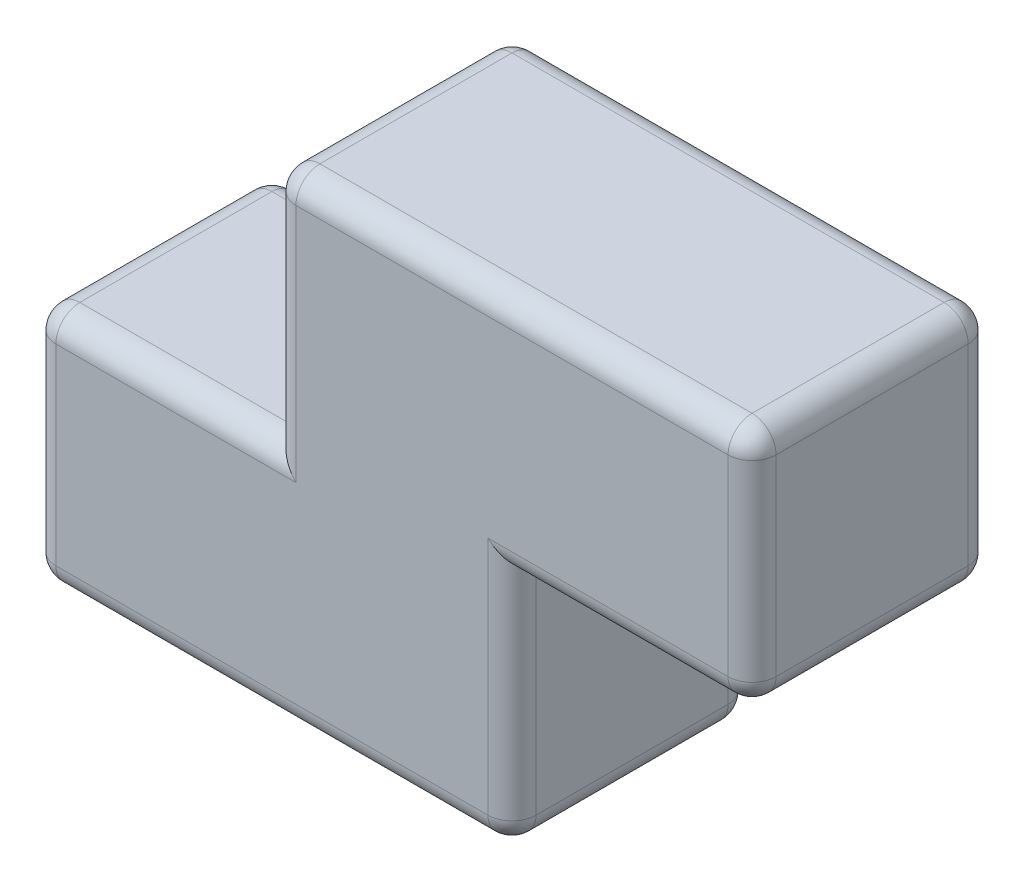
from build123d import *

# Parameters (mm, degrees)
BOSS_EXTRUDE1_DEPTH = 100
FILLET4_R           = 10


with BuildPart() as part:
    # Sketch1 → Boss-Extrude1 (new body)
    with BuildSketch(Plane.XY):
        Polygon((-859.993519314, 14.740311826), (-859.993519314, -85.259688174), (-759.993519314, -85.259688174), (-659.993519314, -85.259688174), (-659.993519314, 14.740311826), (-559.993519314, 14.740311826), (-559.993519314, 114.740311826), (-759.993519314, 114.740311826), (-759.993519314, 14.740311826), align=None)
    extrude(amount=BOSS_EXTRUDE1_DEPTH)

    # Fillet4
    fillet4_edges = [part.edges().sort_by_distance(p)[0] for p in [
        (-759.993519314, -85.259688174, 100),
        (-659.993519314, -35.259688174, 0),
        (-759.993519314, -85.259688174, 0),
        (-859.993519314, -35.259688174, 0),
        (-809.993519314, 14.740311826, 0),
        (-759.993519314, 114.740311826, 50),
        (-559.993519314, 114.740311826, 50),
        (-559.993519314, 14.740311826, 50),
        (-659.993519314, -85.259688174, 50),
        (-859.993519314, -85.259688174, 50),
        (-859.993519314, 14.740311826, 50),
        (-659.993519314, -35.259688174, 100),
        (-609.993519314, 14.740311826, 100),
        (-559.993519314, 64.740311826, 100),
        (-659.993519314, 114.740311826, 100),
        (-759.993519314, 64.740311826, 100),
        (-809.993519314, 14.740311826, 100),
        (-859.993519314, -35.259688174, 100),
        (-759.993519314, 64.740311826, 0),
        (-659.993519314, 114.740311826, 0),
        (-559.993519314, 64.740311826, 0),
        (-609.993519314, 14.740311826, 0),
    ]]
    fillet(fillet4_edges, radius=FILLET4_R)


solid = part.part
